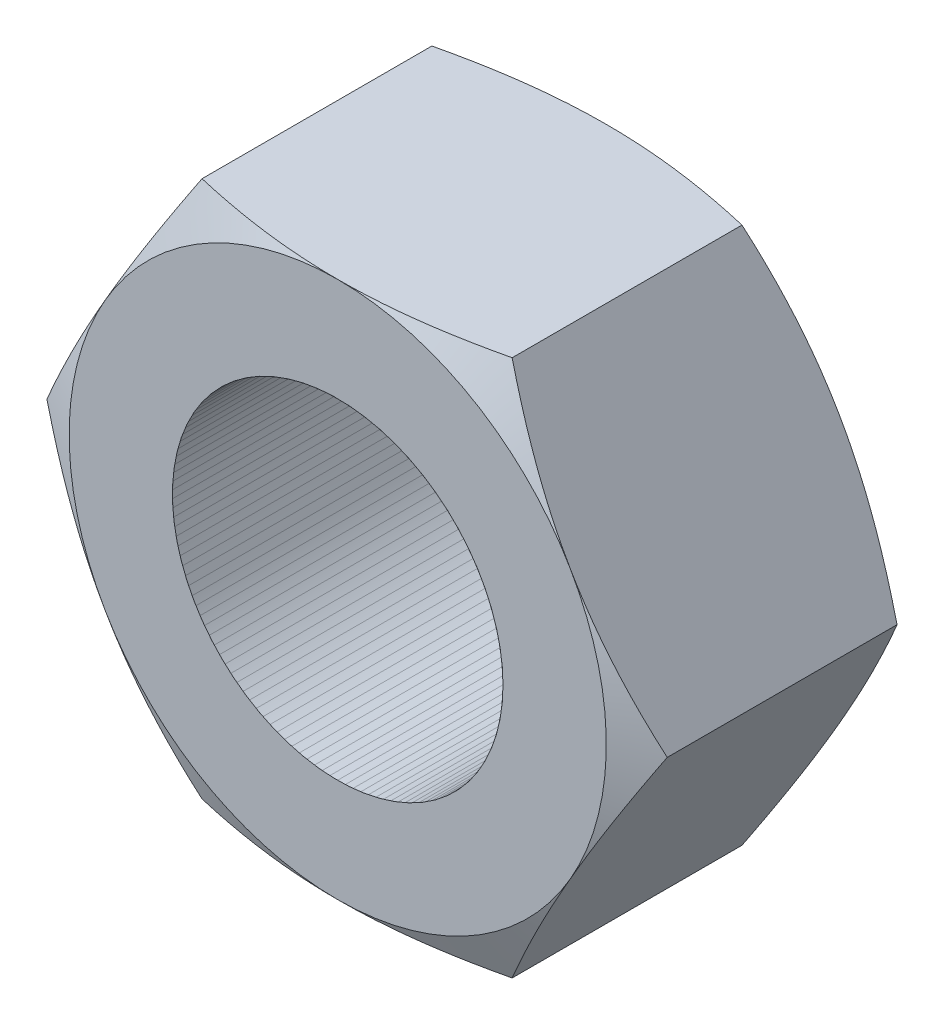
ISO-10303-21;
HEADER;
FILE_DESCRIPTION(('STEP AP214'),'2;1');
FILE_NAME('part.step','',(''),(''),'','','');
FILE_SCHEMA(('AUTOMOTIVE_DESIGN { 1 0 10303 214 1 1 1 1 }'));
ENDSEC;
DATA;
#1=APPLICATION_CONTEXT('core data for automotive mechanical design processes');
#2=APPLICATION_PROTOCOL_DEFINITION('international standard','automotive_design',2000,#1);
#3=PRODUCT_CONTEXT('',#1,'mechanical');
#4=PRODUCT('Part','Part','',(#3));
#5=PRODUCT_RELATED_PRODUCT_CATEGORY('part','',(#4));
#6=PRODUCT_DEFINITION_FORMATION('','',#4);
#7=PRODUCT_DEFINITION_CONTEXT('part definition',#1,'design');
#8=PRODUCT_DEFINITION('design','',#6,#7);
#9=PRODUCT_DEFINITION_SHAPE('','',#8);
#10=(LENGTH_UNIT() NAMED_UNIT(*) SI_UNIT(.MILLI.,.METRE.));
#11=(NAMED_UNIT(*) PLANE_ANGLE_UNIT() SI_UNIT($,.RADIAN.));
#12=(NAMED_UNIT(*) SI_UNIT($,.STERADIAN.) SOLID_ANGLE_UNIT());
#13=UNCERTAINTY_MEASURE_WITH_UNIT(LENGTH_MEASURE(1.E-05),#10,'distance_accuracy_value','');
#14=(GEOMETRIC_REPRESENTATION_CONTEXT(3) GLOBAL_UNCERTAINTY_ASSIGNED_CONTEXT((#13)) GLOBAL_UNIT_ASSIGNED_CONTEXT((#10,
#11,#12)) REPRESENTATION_CONTEXT('',''));
#15=CARTESIAN_POINT('',(0.,0.,0.));
#16=DIRECTION('',(0.,0.,1.));
#17=DIRECTION('',(1.,0.,0.));
#18=AXIS2_PLACEMENT_3D('',#15,#16,#17);
#19=CARTESIAN_POINT('',(0.,0.,6.02828931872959));
#20=DIRECTION('',(0.,0.,-1.));
#21=DIRECTION('',(0.,1.,0.));
#22=AXIS2_PLACEMENT_3D('',#19,#20,#21);
#23=CONICAL_SURFACE('',#22,7.51158682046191,1.1344640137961);
#24=CARTESIAN_POINT('',(-3.75277674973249,-6.49999999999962,6.03110270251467));
#25=CARTESIAN_POINT('',(-3.90672693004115,-6.23335046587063,6.10291701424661));
#26=CARTESIAN_POINT('',(-4.0615065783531,-5.9652642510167,6.16845555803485));
#27=CARTESIAN_POINT('',(-4.37197251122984,-5.42752148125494,6.28382196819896));
#28=CARTESIAN_POINT('',(-4.52765399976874,-5.15787323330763,6.33370190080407));
#29=CARTESIAN_POINT('',(-4.76213692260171,-4.7517368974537,6.39477850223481));
#30=CARTESIAN_POINT('',(-4.84049148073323,-4.61602282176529,6.41285157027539));
#31=CARTESIAN_POINT('',(-4.99744517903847,-4.3441710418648,6.44410021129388));
#32=CARTESIAN_POINT('',(-5.07604431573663,-4.20803334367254,6.45727585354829));
#33=CARTESIAN_POINT('',(-5.23367989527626,-3.93500051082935,6.47850910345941));
#34=CARTESIAN_POINT('',(-5.31271692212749,-3.79810436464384,6.48654948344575));
#35=CARTESIAN_POINT('',(-5.47089023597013,-3.52414014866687,6.49730462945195));
#36=CARTESIAN_POINT('',(-5.55002653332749,-3.38707206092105,6.5000187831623));
#37=CARTESIAN_POINT('',(-5.62916506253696,-3.25000010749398,6.5));
#38=B_SPLINE_CURVE_WITH_KNOTS('',3,(#24,#25,#26,#27,#28,#29,#30,#31,#32,#33,#34,#35,#36,#37),
.UNSPECIFIED.,.F.,.F.,(4,2,2,2,2,2,4),(0.,0.94873235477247,1.89427583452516,2.36744950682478,
2.84061648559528,3.31536261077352,3.7901633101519),.UNSPECIFIED.);
#39=CARTESIAN_POINT('',(-3.75277674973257,-6.49999999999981,6.03110270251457));
#40=VERTEX_POINT('',#39);
#41=CARTESIAN_POINT('',(-5.62916509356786,-3.25000005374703,6.49999999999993));
#42=VERTEX_POINT('',#41);
#43=EDGE_CURVE('P0_E21',#40,#42,#38,.T.);
#44=ORIENTED_EDGE('',*,*,#43,.F.);
#45=CARTESIAN_POINT('',(-2.58310512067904E-10,-6.5,6.49999999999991));
#46=CARTESIAN_POINT('',(-0.158277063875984,-6.5,6.50001878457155));
#47=CARTESIAN_POINT('',(-0.316549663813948,-6.5,6.49730463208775));
#48=CARTESIAN_POINT('',(-0.63289630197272,-6.5,6.48654948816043));
#49=CARTESIAN_POINT('',(-0.790970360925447,-6.5,6.47850910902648));
#50=CARTESIAN_POINT('',(-1.10624153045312,-6.5,6.45727586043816));
#51=CARTESIAN_POINT('',(-1.26343980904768,-6.5,6.44410021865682));
#52=CARTESIAN_POINT('',(-1.57734721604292,-6.5,6.41285157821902));
#53=CARTESIAN_POINT('',(-1.73405633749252,-6.5,6.39477851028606));
#54=CARTESIAN_POINT('',(-2.20302219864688,-6.5,6.33370190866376));
#55=CARTESIAN_POINT('',(-2.51438518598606,-6.5,6.28382197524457));
#56=CARTESIAN_POINT('',(-3.13531707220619,-6.5,6.16845556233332));
#57=CARTESIAN_POINT('',(-3.44487637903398,-6.5,6.10291701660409));
#58=CARTESIAN_POINT('',(-3.75277674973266,-6.5,6.03110270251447));
#59=B_SPLINE_CURVE_WITH_KNOTS('',3,(#45,#46,#47,#48,#49,#50,#51,#52,#53,#54,#55,#56,#57,#58),
.UNSPECIFIED.,.F.,.F.,(4,2,2,2,2,2,4),(0.,0.474800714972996,0.9495468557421,1.42271384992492,
1.89588753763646,2.84143104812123,3.79016343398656),.UNSPECIFIED.);
#60=CARTESIAN_POINT('',(-1.29156532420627E-10,-6.49999999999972,6.50000000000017));
#61=VERTEX_POINT('',#60);
#62=EDGE_CURVE('P0_E122',#61,#40,#59,.T.);
#63=ORIENTED_EDGE('',*,*,#62,.F.);
#64=CARTESIAN_POINT('',(0.,0.,6.49999999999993));
#65=DIRECTION('',(0.,0.,-1.));
#66=DIRECTION('',(0.,1.,0.));
#67=AXIS2_PLACEMENT_3D('',#64,#65,#66);
#68=CIRCLE('',#67,6.49999999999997);
#69=EDGE_CURVE('P0_E120',#42,#61,#68,.F.);
#70=ORIENTED_EDGE('',*,*,#69,.F.);
#71=EDGE_LOOP('',(#44,#63,#70));
#72=FACE_BOUND('',#71,.T.);
#73=ADVANCED_FACE('P0_F17',(#72),#23,.T.);
#74=CARTESIAN_POINT('',(0.,0.,6.02828931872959));
#75=DIRECTION('',(0.,0.,-1.));
#76=DIRECTION('',(-1.,0.,0.));
#77=AXIS2_PLACEMENT_3D('',#74,#75,#76);
#78=CONICAL_SURFACE('',#77,7.51158682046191,1.1344640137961);
#79=CARTESIAN_POINT('',(3.75277674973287,-6.5,6.03110270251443));
#80=CARTESIAN_POINT('',(3.44487637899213,-6.5,6.10291701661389));
#81=CARTESIAN_POINT('',(3.13531707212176,-6.5,6.16845556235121));
#82=CARTESIAN_POINT('',(2.51438518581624,-6.5,6.28382197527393));
#83=CARTESIAN_POINT('',(2.20302219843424,-6.5,6.33370190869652));
#84=CARTESIAN_POINT('',(1.73405633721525,-6.5,6.39477851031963));
#85=CARTESIAN_POINT('',(1.57734721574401,-6.5,6.41285157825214));
#86=CARTESIAN_POINT('',(1.26343980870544,-6.5,6.44410021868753));
#87=CARTESIAN_POINT('',(1.10624153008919,-6.5,6.45727586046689));
#88=CARTESIAN_POINT('',(0.790970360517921,-6.5,6.47850910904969));
#89=CARTESIAN_POINT('',(0.632896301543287,-6.5,6.4865494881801));
#90=CARTESIAN_POINT('',(0.316549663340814,-6.5,6.49730463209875));
#91=CARTESIAN_POINT('',(0.158277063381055,-6.5,6.50001878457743));
#92=CARTESIAN_POINT('',(-2.58309852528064E-10,-6.5,6.49999999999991));
#93=B_SPLINE_CURVE_WITH_KNOTS('',3,(#79,#80,#81,#82,#83,#84,#85,#86,#87,#88,#89,#90,#91,#92),
.UNSPECIFIED.,.F.,.F.,(4,2,2,2,2,2,4),(0.,0.948732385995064,1.89427589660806,2.36744958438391,
2.84061657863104,3.3153627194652,3.79016343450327),.UNSPECIFIED.);
#94=CARTESIAN_POINT('',(3.75277674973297,-6.49999999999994,6.03110270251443));
#95=VERTEX_POINT('',#94);
#96=EDGE_CURVE('P0_E142',#95,#61,#93,.T.);
#97=ORIENTED_EDGE('',*,*,#96,.F.);
#98=CARTESIAN_POINT('',(5.62916512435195,-3.25000000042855,6.4999999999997));
#99=CARTESIAN_POINT('',(5.55002659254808,-3.38707195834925,6.50001878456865));
#100=CARTESIAN_POINT('',(5.47089029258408,-3.52414005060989,6.49730463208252));
#101=CARTESIAN_POINT('',(5.3127169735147,-3.79810427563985,6.48654948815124));
#102=CARTESIAN_POINT('',(5.23367994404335,-3.93500042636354,6.47850910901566));
#103=CARTESIAN_POINT('',(5.07604435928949,-4.20803326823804,6.45727586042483));
#104=CARTESIAN_POINT('',(4.99744521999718,-4.34417097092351,6.4441002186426));
#105=CARTESIAN_POINT('',(4.84049151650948,-4.6160227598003,6.4128515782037));
#106=CARTESIAN_POINT('',(4.76213695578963,-4.75173683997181,6.39477851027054));
#107=CARTESIAN_POINT('',(4.52765402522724,-5.15787318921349,6.33370190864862));
#108=CARTESIAN_POINT('',(4.37197253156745,-5.42752144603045,6.28382197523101));
#109=CARTESIAN_POINT('',(4.06150658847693,-5.965264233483,6.16845556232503));
#110=CARTESIAN_POINT('',(3.90672693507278,-6.23335045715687,6.10291701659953));
#111=CARTESIAN_POINT('',(3.75277674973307,-6.49999999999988,6.03110270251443));
#112=B_SPLINE_CURVE_WITH_KNOTS('',3,(#98,#99,#100,#101,#102,#103,#104,#105,#106,#107,#108,#109,
#110,#111),.UNSPECIFIED.,.F.,.F.,(4,2,2,2,2,2,4),(0.,0.47480071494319,0.949546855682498,
1.42271384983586,1.89588753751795,2.84143104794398,3.79016343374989),.UNSPECIFIED.);
#113=CARTESIAN_POINT('',(5.62916512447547,-3.25000000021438,6.49999999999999));
#114=VERTEX_POINT('',#113);
#115=EDGE_CURVE('P0_E291',#114,#95,#112,.T.);
#116=ORIENTED_EDGE('',*,*,#115,.F.);
#117=CARTESIAN_POINT('',(0.,0.,6.50000000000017));
#118=DIRECTION('',(0.,0.,-1.));
#119=DIRECTION('',(-1.,0.,0.));
#120=AXIS2_PLACEMENT_3D('',#117,#118,#119);
#121=CIRCLE('',#120,6.49999999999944);
#122=EDGE_CURVE('P0_E125',#61,#114,#121,.F.);
#123=ORIENTED_EDGE('',*,*,#122,.F.);
#124=EDGE_LOOP('',(#97,#116,#123));
#125=FACE_BOUND('',#124,.T.);
#126=ADVANCED_FACE('P0_F281',(#125),#78,.T.);
#127=CARTESIAN_POINT('',(0.,0.,6.02828931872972));
#128=DIRECTION('',(0.,0.,-1.));
#129=DIRECTION('',(-1.,0.,0.));
#130=AXIS2_PLACEMENT_3D('',#127,#128,#129);
#131=CONICAL_SURFACE('',#130,7.51158682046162,1.1344640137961);
#132=CARTESIAN_POINT('',(5.62916507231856,3.25000009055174,6.5));
#133=CARTESIAN_POINT('',(5.70830360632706,3.11292812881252,6.50001878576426));
#134=CARTESIAN_POINT('',(5.78743990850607,2.97586003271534,6.49730463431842));
#135=CARTESIAN_POINT('',(5.94561323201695,2.70189579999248,6.48654949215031));
#136=CARTESIAN_POINT('',(6.02465026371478,2.56499964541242,6.47850911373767));
#137=CARTESIAN_POINT('',(6.1822858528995,2.29196679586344,6.45727586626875));
#138=CARTESIAN_POINT('',(6.26088499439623,2.15582908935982,6.44410022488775));
#139=CARTESIAN_POINT('',(6.41783870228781,1.88397729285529,6.41285158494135));
#140=CARTESIAN_POINT('',(6.49619326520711,1.7482632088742,6.39477851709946));
#141=CARTESIAN_POINT('',(6.73067620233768,1.3421268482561,6.33370191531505));
#142=CARTESIAN_POINT('',(6.88635770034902,1.07247858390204,6.28382198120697));
#143=CARTESIAN_POINT('',(7.19682365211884,0.534735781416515,6.16845556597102));
#144=CARTESIAN_POINT('',(7.35160330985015,0.26664955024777,6.10291701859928));
#145=CARTESIAN_POINT('',(7.50555349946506,0.,6.03110270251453));
#146=B_SPLINE_CURVE_WITH_KNOTS('',3,(#132,#133,#134,#135,#136,#137,#138,#139,#140,#141,#142,
#143,#144,#145),.UNSPECIFIED.,.F.,.F.,(4,2,2,2,2,2,4),(0.,0.474800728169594,0.949546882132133,
1.42271388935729,1.89588759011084,2.84143112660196,3.79016353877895),.UNSPECIFIED.);
#147=CARTESIAN_POINT('',(5.62916509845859,3.25000004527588,6.4999999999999));
#148=VERTEX_POINT('',#147);
#149=CARTESIAN_POINT('',(7.50555349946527,-2.73661070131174E-13,6.03110270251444));
#150=VERTEX_POINT('',#149);
#151=EDGE_CURVE('P0_E261',#148,#150,#146,.T.);
#152=ORIENTED_EDGE('',*,*,#151,.F.);
#153=CARTESIAN_POINT('',(0.,0.,6.4999999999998));
#154=DIRECTION('',(0.,0.,-1.));
#155=DIRECTION('',(-1.,0.,0.));
#156=AXIS2_PLACEMENT_3D('',#153,#154,#155);
#157=CIRCLE('',#156,6.50000000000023);
#158=EDGE_CURVE('P0_E351',#114,#148,#157,.F.);
#159=ORIENTED_EDGE('',*,*,#158,.F.);
#160=CARTESIAN_POINT('',(7.50555349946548,-4.51244910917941E-13,6.03110270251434));
#161=CARTESIAN_POINT('',(7.35160331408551,-0.266649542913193,6.10291701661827));
#162=CARTESIAN_POINT('',(7.19682366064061,-0.534735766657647,6.16845556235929));
#163=CARTESIAN_POINT('',(6.88635771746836,-1.07247855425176,6.28382197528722));
#164=CARTESIAN_POINT('',(6.73067622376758,-1.34212681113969,6.33370190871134));
#165=CARTESIAN_POINT('',(6.49619329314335,-1.74826316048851,6.39477851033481));
#166=CARTESIAN_POINT('',(6.41783873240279,-1.88397724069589,6.41285157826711));
#167=CARTESIAN_POINT('',(6.26088502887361,-2.15582902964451,6.44410021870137));
#168=CARTESIAN_POINT('',(6.18228588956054,-2.29196673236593,6.45727586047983));
#169=CARTESIAN_POINT('',(6.02465030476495,-2.5649995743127,6.47850910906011));
#170=CARTESIAN_POINT('',(5.94561327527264,-2.70189572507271,6.48654948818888));
#171=CARTESIAN_POINT('',(5.78743995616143,-2.97585995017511,6.49730463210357));
#172=CARTESIAN_POINT('',(5.70830365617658,-3.11292804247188,6.50001878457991));
#173=CARTESIAN_POINT('',(5.62916512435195,-3.25000000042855,6.4999999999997));
#174=B_SPLINE_CURVE_WITH_KNOTS('',3,(#160,#161,#162,#163,#164,#165,#166,#167,#168,#169,#170,
#171,#172,#173),.UNSPECIFIED.,.F.,.F.,(4,2,2,2,2,2,4),(0.,0.94873238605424,1.89427589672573,
2.36744958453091,2.84061657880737,3.3153627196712,3.79016343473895),.UNSPECIFIED.);
#175=EDGE_CURVE('P0_E287',#150,#114,#174,.T.);
#176=ORIENTED_EDGE('',*,*,#175,.F.);
#177=EDGE_LOOP('',(#152,#159,#176));
#178=FACE_BOUND('',#177,.T.);
#179=ADVANCED_FACE('P0_F277',(#178),#131,.T.);
#180=CARTESIAN_POINT('',(0.,0.,6.02828931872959));
#181=DIRECTION('',(0.,0.,-1.));
#182=DIRECTION('',(-1.,0.,0.));
#183=AXIS2_PLACEMENT_3D('',#180,#181,#182);
#184=CONICAL_SURFACE('',#183,7.51158682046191,1.1344640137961);
#185=CARTESIAN_POINT('',(3.75277674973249,6.49999999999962,6.03110270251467));
#186=CARTESIAN_POINT('',(3.90672693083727,6.23335046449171,6.10291701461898));
#187=CARTESIAN_POINT('',(4.06150657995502,5.9652642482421,6.16845555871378));
#188=CARTESIAN_POINT('',(4.371972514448,5.42752147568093,6.28382196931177));
#189=CARTESIAN_POINT('',(4.52765400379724,5.15787322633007,6.33370190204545));
#190=CARTESIAN_POINT('',(4.76213692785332,4.75173688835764,6.39477850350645));
#191=CARTESIAN_POINT('',(4.84049148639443,4.61602281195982,6.41285157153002));
#192=CARTESIAN_POINT('',(4.99744518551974,4.34417103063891,6.44410021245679));
#193=CARTESIAN_POINT('',(5.07604432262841,4.20803333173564,6.45727585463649));
#194=CARTESIAN_POINT('',(5.23367990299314,3.93500049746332,6.47850910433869));
#195=CARTESIAN_POINT('',(5.31271693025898,3.79810435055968,6.4865494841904));
#196=CARTESIAN_POINT('',(5.47089024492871,3.52414013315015,6.49730462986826));
#197=CARTESIAN_POINT('',(5.55002654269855,3.3870720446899,6.50001878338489));
#198=CARTESIAN_POINT('',(5.62916507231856,3.25000009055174,6.5));
#199=B_SPLINE_CURVE_WITH_KNOTS('',3,(#185,#186,#187,#188,#189,#190,#191,#192,#193,#194,#195,
#196,#197,#198),.UNSPECIFIED.,.F.,.F.,(4,2,2,2,2,2,4),(0.,0.948732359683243,1.89427584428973,
2.36744951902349,2.8406165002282,3.31536262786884,3.79016332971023),.UNSPECIFIED.);
#200=CARTESIAN_POINT('',(3.75277674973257,6.49999999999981,6.03110270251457));
#201=VERTEX_POINT('',#200);
#202=EDGE_CURVE('P0_E268',#201,#148,#199,.T.);
#203=ORIENTED_EDGE('',*,*,#202,.F.);
#204=CARTESIAN_POINT('',(2.58309719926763E-10,6.5,6.49999999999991));
#205=CARTESIAN_POINT('',(0.158277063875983,6.5,6.50001878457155));
#206=CARTESIAN_POINT('',(0.316549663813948,6.5,6.49730463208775));
#207=CARTESIAN_POINT('',(0.632896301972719,6.5,6.48654948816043));
#208=CARTESIAN_POINT('',(0.790970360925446,6.5,6.47850910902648));
#209=CARTESIAN_POINT('',(1.10624153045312,6.5,6.45727586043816));
#210=CARTESIAN_POINT('',(1.26343980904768,6.5,6.44410021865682));
#211=CARTESIAN_POINT('',(1.57734721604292,6.5,6.41285157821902));
#212=CARTESIAN_POINT('',(1.73405633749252,6.5,6.39477851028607));
#213=CARTESIAN_POINT('',(2.20302219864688,6.5,6.33370190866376));
#214=CARTESIAN_POINT('',(2.51438518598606,6.5,6.28382197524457));
#215=CARTESIAN_POINT('',(3.13531707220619,6.5,6.16845556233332));
#216=CARTESIAN_POINT('',(3.44487637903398,6.5,6.10291701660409));
#217=CARTESIAN_POINT('',(3.75277674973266,6.5,6.03110270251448));
#218=B_SPLINE_CURVE_WITH_KNOTS('',3,(#204,#205,#206,#207,#208,#209,#210,#211,#212,#213,#214,
#215,#216,#217),.UNSPECIFIED.,.F.,.F.,(4,2,2,2,2,2,4),(0.,0.474800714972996,0.949546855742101,
1.42271384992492,1.89588753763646,2.84143104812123,3.79016343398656),.UNSPECIFIED.);
#219=CARTESIAN_POINT('',(1.29154859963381E-10,6.5,6.50000000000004));
#220=VERTEX_POINT('',#219);
#221=EDGE_CURVE('P0_E173',#220,#201,#218,.T.);
#222=ORIENTED_EDGE('',*,*,#221,.F.);
#223=CARTESIAN_POINT('',(0.,0.,6.49999999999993));
#224=DIRECTION('',(0.,0.,-1.));
#225=DIRECTION('',(-1.,0.,0.));
#226=AXIS2_PLACEMENT_3D('',#223,#224,#225);
#227=CIRCLE('',#226,6.49999999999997);
#228=EDGE_CURVE('P0_E349',#148,#220,#227,.F.);
#229=ORIENTED_EDGE('',*,*,#228,.F.);
#230=EDGE_LOOP('',(#203,#222,#229));
#231=FACE_BOUND('',#230,.T.);
#232=ADVANCED_FACE('P0_F280',(#231),#184,.T.);
#233=CARTESIAN_POINT('',(0.,0.,6.02828931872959));
#234=DIRECTION('',(0.,0.,-1.));
#235=DIRECTION('',(-1.,0.,0.));
#236=AXIS2_PLACEMENT_3D('',#233,#234,#235);
#237=CONICAL_SURFACE('',#236,7.51158682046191,1.1344640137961);
#238=CARTESIAN_POINT('',(-3.75277674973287,6.5,6.03110270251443));
#239=CARTESIAN_POINT('',(-3.44487637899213,6.5,6.10291701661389));
#240=CARTESIAN_POINT('',(-3.13531707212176,6.5,6.16845556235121));
#241=CARTESIAN_POINT('',(-2.51438518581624,6.5,6.28382197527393));
#242=CARTESIAN_POINT('',(-2.20302219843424,6.5,6.33370190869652));
#243=CARTESIAN_POINT('',(-1.73405633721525,6.5,6.39477851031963));
#244=CARTESIAN_POINT('',(-1.57734721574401,6.5,6.41285157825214));
#245=CARTESIAN_POINT('',(-1.26343980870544,6.5,6.44410021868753));
#246=CARTESIAN_POINT('',(-1.10624153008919,6.5,6.45727586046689));
#247=CARTESIAN_POINT('',(-0.79097036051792,6.5,6.47850910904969));
#248=CARTESIAN_POINT('',(-0.632896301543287,6.5,6.4865494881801));
#249=CARTESIAN_POINT('',(-0.316549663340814,6.5,6.49730463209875));
#250=CARTESIAN_POINT('',(-0.158277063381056,6.5,6.50001878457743));
#251=CARTESIAN_POINT('',(2.58309825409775E-10,6.5,6.49999999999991));
#252=B_SPLINE_CURVE_WITH_KNOTS('',3,(#238,#239,#240,#241,#242,#243,#244,#245,#246,#247,#248,
#249,#250,#251),.UNSPECIFIED.,.F.,.F.,(4,2,2,2,2,2,4),(0.,0.948732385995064,1.89427589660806,
2.36744958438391,2.84061657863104,3.3153627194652,3.79016343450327),.UNSPECIFIED.);
#253=CARTESIAN_POINT('',(-3.75277674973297,6.49999999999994,6.03110270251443));
#254=VERTEX_POINT('',#253);
#255=EDGE_CURVE('P0_E269',#254,#220,#252,.T.);
#256=ORIENTED_EDGE('',*,*,#255,.F.);
#257=CARTESIAN_POINT('',(-5.62916512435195,3.25000000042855,6.4999999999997));
#258=CARTESIAN_POINT('',(-5.55002659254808,3.38707195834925,6.50001878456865));
#259=CARTESIAN_POINT('',(-5.47089029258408,3.52414005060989,6.49730463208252));
#260=CARTESIAN_POINT('',(-5.3127169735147,3.79810427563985,6.48654948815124));
#261=CARTESIAN_POINT('',(-5.23367994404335,3.93500042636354,6.47850910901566));
#262=CARTESIAN_POINT('',(-5.07604435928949,4.20803326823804,6.45727586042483));
#263=CARTESIAN_POINT('',(-4.99744521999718,4.34417097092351,6.4441002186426));
#264=CARTESIAN_POINT('',(-4.84049151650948,4.6160227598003,6.4128515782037));
#265=CARTESIAN_POINT('',(-4.76213695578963,4.75173683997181,6.39477851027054));
#266=CARTESIAN_POINT('',(-4.52765402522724,5.15787318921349,6.33370190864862));
#267=CARTESIAN_POINT('',(-4.37197253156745,5.42752144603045,6.28382197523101));
#268=CARTESIAN_POINT('',(-4.06150658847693,5.965264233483,6.16845556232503));
#269=CARTESIAN_POINT('',(-3.90672693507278,6.23335045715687,6.10291701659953));
#270=CARTESIAN_POINT('',(-3.75277674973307,6.49999999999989,6.03110270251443));
#271=B_SPLINE_CURVE_WITH_KNOTS('',3,(#257,#258,#259,#260,#261,#262,#263,#264,#265,#266,#267,
#268,#269,#270),.UNSPECIFIED.,.F.,.F.,(4,2,2,2,2,2,4),(0.,0.474800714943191,0.949546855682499,
1.42271384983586,1.89588753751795,2.84143104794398,3.79016343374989),.UNSPECIFIED.);
#272=CARTESIAN_POINT('',(-5.62916512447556,3.25000000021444,6.49999999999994));
#273=VERTEX_POINT('',#272);
#274=EDGE_CURVE('P0_E126',#273,#254,#271,.T.);
#275=ORIENTED_EDGE('',*,*,#274,.F.);
#276=CARTESIAN_POINT('',(0.,0.,6.50000000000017));
#277=DIRECTION('',(0.,0.,-1.));
#278=DIRECTION('',(-1.,0.,0.));
#279=AXIS2_PLACEMENT_3D('',#276,#277,#278);
#280=CIRCLE('',#279,6.49999999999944);
#281=EDGE_CURVE('P0_E134',#220,#273,#280,.F.);
#282=ORIENTED_EDGE('',*,*,#281,.F.);
#283=EDGE_LOOP('',(#256,#275,#282));
#284=FACE_BOUND('',#283,.T.);
#285=ADVANCED_FACE('P0_F158',(#284),#237,.T.);
#286=CARTESIAN_POINT('',(0.,0.,6.02828931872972));
#287=DIRECTION('',(0.,0.,-1.));
#288=DIRECTION('',(-1.,0.,0.));
#289=AXIS2_PLACEMENT_3D('',#286,#287,#288);
#290=CONICAL_SURFACE('',#289,7.51158682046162,1.1344640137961);
#291=CARTESIAN_POINT('',(-7.5055534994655,4.06582802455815E-13,6.03110270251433));
#292=CARTESIAN_POINT('',(-7.35160331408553,0.266649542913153,6.10291701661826));
#293=CARTESIAN_POINT('',(-7.19682366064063,0.534735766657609,6.16845556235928));
#294=CARTESIAN_POINT('',(-6.88635771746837,1.07247855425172,6.28382197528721));
#295=CARTESIAN_POINT('',(-6.7306762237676,1.34212681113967,6.33370190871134));
#296=CARTESIAN_POINT('',(-6.49619329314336,1.74826316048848,6.3947785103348));
#297=CARTESIAN_POINT('',(-6.4178387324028,1.88397724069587,6.4128515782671));
#298=CARTESIAN_POINT('',(-6.26088502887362,2.1558290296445,6.44410021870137));
#299=CARTESIAN_POINT('',(-6.18228588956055,2.29196673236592,6.45727586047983));
#300=CARTESIAN_POINT('',(-6.02465030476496,2.56499957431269,6.47850910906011));
#301=CARTESIAN_POINT('',(-5.94561327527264,2.7018957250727,6.48654948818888));
#302=CARTESIAN_POINT('',(-5.78743995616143,2.97585995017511,6.49730463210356));
#303=CARTESIAN_POINT('',(-5.70830365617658,3.11292804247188,6.5000187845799));
#304=CARTESIAN_POINT('',(-5.62916512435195,3.25000000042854,6.4999999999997));
#305=B_SPLINE_CURVE_WITH_KNOTS('',3,(#291,#292,#293,#294,#295,#296,#297,#298,#299,#300,#301,
#302,#303,#304),.UNSPECIFIED.,.F.,.F.,(4,2,2,2,2,2,4),(0.,0.948732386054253,1.89427589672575,
2.36744958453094,2.84061657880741,3.31536271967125,3.790163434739),.UNSPECIFIED.);
#306=CARTESIAN_POINT('',(-7.50555349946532,2.29273092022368E-13,6.03110270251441));
#307=VERTEX_POINT('',#306);
#308=EDGE_CURVE('P0_E141',#307,#273,#305,.T.);
#309=ORIENTED_EDGE('',*,*,#308,.F.);
#310=CARTESIAN_POINT('',(-5.62916506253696,-3.25000010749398,6.5));
#311=CARTESIAN_POINT('',(-5.708303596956,-3.11292814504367,6.50001878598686));
#312=CARTESIAN_POINT('',(-5.78743989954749,-2.97586004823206,6.49730463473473));
#313=CARTESIAN_POINT('',(-5.94561322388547,-2.70189581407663,6.48654949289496));
#314=CARTESIAN_POINT('',(-6.0246502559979,-2.56499965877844,6.47850911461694));
#315=CARTESIAN_POINT('',(-6.18228584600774,-2.29196680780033,6.45727586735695));
#316=CARTESIAN_POINT('',(-6.26088498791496,-2.1558291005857,6.44410022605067));
#317=CARTESIAN_POINT('',(-6.41783869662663,-1.88397730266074,6.41285158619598));
#318=CARTESIAN_POINT('',(-6.49619325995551,-1.74826321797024,6.39477851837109));
#319=CARTESIAN_POINT('',(-6.7306761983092,-1.34212685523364,6.33370191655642));
#320=CARTESIAN_POINT('',(-6.88635769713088,-1.07247858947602,6.28382198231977));
#321=CARTESIAN_POINT('',(-7.19682365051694,-0.534735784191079,6.16845556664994));
#322=CARTESIAN_POINT('',(-7.35160330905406,-0.266649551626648,6.10291701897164));
#323=CARTESIAN_POINT('',(-7.50555349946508,1.40998818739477E-13,6.03110270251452));
#324=B_SPLINE_CURVE_WITH_KNOTS('',3,(#310,#311,#312,#313,#314,#315,#316,#317,#318,#319,#320,
#321,#322,#323),.UNSPECIFIED.,.F.,.F.,(4,2,2,2,2,2,4),(0.,0.474800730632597,0.949546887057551,
1.42271389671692,1.89588759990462,2.84143114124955,3.79016355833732),.UNSPECIFIED.);
#325=EDGE_CURVE('P0_E115',#42,#307,#324,.T.);
#326=ORIENTED_EDGE('',*,*,#325,.F.);
#327=CARTESIAN_POINT('',(0.,0.,6.49999999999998));
#328=DIRECTION('',(0.,0.,-1.));
#329=DIRECTION('',(-1.,0.,0.));
#330=AXIS2_PLACEMENT_3D('',#327,#328,#329);
#331=CIRCLE('',#330,6.49999999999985);
#332=EDGE_CURVE('P0_E130',#273,#42,#331,.F.);
#333=ORIENTED_EDGE('',*,*,#332,.F.);
#334=EDGE_LOOP('',(#309,#326,#333));
#335=FACE_BOUND('',#334,.T.);
#336=ADVANCED_FACE('P0_F140',(#335),#290,.T.);
#337=CARTESIAN_POINT('',(-7.505553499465,0.,0.));
#338=DIRECTION('',(-0.866025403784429,-0.500000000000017,0.));
#339=DIRECTION('',(0.500000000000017,-0.866025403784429,0.));
#340=AXIS2_PLACEMENT_3D('',#337,#338,#339);
#341=PLANE('',#340);
#342=ORIENTED_EDGE('',*,*,#43,.T.);
#343=ORIENTED_EDGE('',*,*,#325,.T.);
#344=DIRECTION('',(0.,0.,1.));
#345=VECTOR('',#344,1.);
#346=CARTESIAN_POINT('',(-7.50555349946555,3.17454396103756E-13,0.));
#347=LINE('',#346,#345);
#348=CARTESIAN_POINT('',(-7.50555347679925,-3.92585487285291E-08,0.468897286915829));
#349=VERTEX_POINT('',#348);
#350=EDGE_CURVE('P0_E169',#349,#307,#347,.T.);
#351=ORIENTED_EDGE('',*,*,#350,.F.);
#352=CARTESIAN_POINT('',(-5.6291651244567,-3.25000000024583,-3.95874665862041E-13));
#353=CARTESIAN_POINT('',(-5.70830365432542,-3.1129280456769,-1.87845763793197E-05));
#354=CARTESIAN_POINT('',(-5.78743995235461,-2.97585995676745,0.00269536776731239));
#355=CARTESIAN_POINT('',(-5.94561326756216,-2.70189573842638,0.013450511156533));
#356=CARTESIAN_POINT('',(-6.02465029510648,-2.5649995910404,0.0214908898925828));
#357=CARTESIAN_POINT('',(-6.18228587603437,-2.29196675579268,0.0427241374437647));
#358=CARTESIAN_POINT('',(-6.26088501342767,-2.1558290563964,0.0558997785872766));
#359=CARTESIAN_POINT('',(-6.41783871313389,-1.88397727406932,0.0871484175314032));
#360=CARTESIAN_POINT('',(-6.49619327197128,-1.74826319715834,0.105221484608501));
#361=CARTESIAN_POINT('',(-6.73067619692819,-1.34212685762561,0.166298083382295));
#362=CARTESIAN_POINT('',(-6.88635768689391,-1.07247860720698,0.216178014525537));
#363=CARTESIAN_POINT('',(-7.19682362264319,-0.534735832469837,0.331544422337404));
#364=CARTESIAN_POINT('',(-7.3516032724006,-0.266649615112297,0.397082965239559));
#365=CARTESIAN_POINT('',(-7.50555345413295,-7.85174151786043E-08,0.46889727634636));
#366=B_SPLINE_CURVE_WITH_KNOTS('',3,(#352,#353,#354,#355,#356,#357,#358,#359,#360,#361,#362,
#363,#364,#365),.UNSPECIFIED.,.F.,.F.,(4,2,2,2,2,2,4),(0.,0.474800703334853,0.949546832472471,
1.42271381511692,1.89588749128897,2.84143097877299,3.79016334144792),.UNSPECIFIED.);
#367=CARTESIAN_POINT('',(-5.62916512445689,-3.25000000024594,-2.95341065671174E-13));
#368=VERTEX_POINT('',#367);
#369=EDGE_CURVE('P0_E138',#368,#349,#366,.T.);
#370=ORIENTED_EDGE('',*,*,#369,.F.);
#371=CARTESIAN_POINT('',(-3.75277679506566,-6.49999992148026,0.468897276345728));
#372=CARTESIAN_POINT('',(-3.9067269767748,-6.23335038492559,0.397082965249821));
#373=CARTESIAN_POINT('',(-4.06150662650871,-5.96526416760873,0.331544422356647));
#374=CARTESIAN_POINT('',(-4.37197256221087,-5.42752139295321,0.216178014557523));
#375=CARTESIAN_POINT('',(-4.52765405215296,-5.1578731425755,0.16629808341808));
#376=CARTESIAN_POINT('',(-4.76213697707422,-4.75173680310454,0.105221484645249));
#377=CARTESIAN_POINT('',(-4.84049153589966,-4.61602272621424,0.0871484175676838));
#378=CARTESIAN_POINT('',(-4.99744523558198,-4.34417094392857,0.0558997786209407));
#379=CARTESIAN_POINT('',(-5.07604437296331,-4.20803324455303,0.0427241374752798));
#380=CARTESIAN_POINT('',(-5.23367995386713,-3.93500040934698,0.0214908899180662));
#381=CARTESIAN_POINT('',(-5.31271698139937,-3.79810426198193,0.0134505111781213));
#382=CARTESIAN_POINT('',(-5.4708902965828,-3.52414004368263,0.00269536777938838));
#383=CARTESIAN_POINT('',(-5.55002659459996,-3.38707195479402,-1.87845699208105E-05));
#384=CARTESIAN_POINT('',(-5.6291651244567,-3.25000000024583,-3.96136663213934E-13));
#385=B_SPLINE_CURVE_WITH_KNOTS('',3,(#371,#372,#373,#374,#375,#376,#377,#378,#379,#380,#381,
#382,#383,#384),.UNSPECIFIED.,.F.,.F.,(4,2,2,2,2,2,4),(0.,0.948732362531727,1.89427584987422,
2.36744952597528,2.84061650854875,3.31536263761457,3.7901633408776),.UNSPECIFIED.);
#386=CARTESIAN_POINT('',(-3.75277676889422,-6.5,0.468897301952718));
#387=VERTEX_POINT('',#386);
#388=EDGE_CURVE('P0_E333',#387,#368,#385,.T.);
#389=ORIENTED_EDGE('',*,*,#388,.F.);
#390=DIRECTION('',(0.,0.,-1.));
#391=VECTOR('',#390,1.);
#392=CARTESIAN_POINT('',(-3.752776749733,-6.5,0.));
#393=LINE('',#392,#391);
#394=EDGE_CURVE('P0_E118',#40,#387,#393,.T.);
#395=ORIENTED_EDGE('',*,*,#394,.F.);
#396=EDGE_LOOP('',(#342,#343,#351,#370,#389,#395));
#397=FACE_BOUND('',#396,.T.);
#398=ADVANCED_FACE('P0_F112',(#397),#341,.T.);
#399=CARTESIAN_POINT('',(-3.752776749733,-6.5,0.));
#400=DIRECTION('',(0.,-1.,0.));
#401=DIRECTION('',(0.,0.,-1.));
#402=AXIS2_PLACEMENT_3D('',#399,#400,#401);
#403=PLANE('',#402);
#404=ORIENTED_EDGE('',*,*,#96,.T.);
#405=ORIENTED_EDGE('',*,*,#62,.T.);
#406=ORIENTED_EDGE('',*,*,#394,.T.);
#407=CARTESIAN_POINT('',(-2.58312926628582E-10,-6.5,-3.07986611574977E-13));
#408=CARTESIAN_POINT('',(-0.158277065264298,-6.5,-1.87845725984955E-05));
#409=CARTESIAN_POINT('',(-0.316549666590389,-6.5,0.00269536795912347));
#410=CARTESIAN_POINT('',(-0.63289630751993,-6.5,0.0134505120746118));
#411=CARTESIAN_POINT('',(-0.790970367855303,-6.5,0.0214908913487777));
#412=CARTESIAN_POINT('',(-1.10624154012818,-6.5,0.0427241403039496));
#413=CARTESIAN_POINT('',(-1.26343982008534,-6.5,0.055899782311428));
#414=CARTESIAN_POINT('',(-1.57734722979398,-6.5,0.0871484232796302));
#415=CARTESIAN_POINT('',(-1.73405635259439,-6.5,0.105221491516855));
#416=CARTESIAN_POINT('',(-2.20302221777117,-6.5,0.166298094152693));
#417=CARTESIAN_POINT('',(-2.51438520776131,-6.5,0.21617802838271));
#418=CARTESIAN_POINT('',(-3.13531709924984,-6.5,0.331544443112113));
#419=CARTESIAN_POINT('',(-3.44487640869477,-6.5,0.397082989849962));
#420=CARTESIAN_POINT('',(-3.75277678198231,-6.5,0.468897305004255));
#421=B_SPLINE_CURVE_WITH_KNOTS('',3,(#407,#408,#409,#410,#411,#412,#413,#414,#415,#416,#417,
#418,#419,#420),.UNSPECIFIED.,.F.,.F.,(4,2,2,2,2,2,4),(0.,0.474800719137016,0.949546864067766,
1.42271386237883,1.89588755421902,2.84143107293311,3.79016346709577),.UNSPECIFIED.);
#422=CARTESIAN_POINT('',(-2.58314189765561E-10,-6.50000000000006,-2.80492594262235E-13));
#423=VERTEX_POINT('',#422);
#424=EDGE_CURVE('P0_E306',#423,#387,#421,.T.);
#425=ORIENTED_EDGE('',*,*,#424,.F.);
#426=CARTESIAN_POINT('',(3.75277665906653,-6.5,0.468897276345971));
#427=CARTESIAN_POINT('',(3.44487629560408,-6.5,0.397082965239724));
#428=CARTESIAN_POINT('',(3.13531699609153,-6.5,0.331544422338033));
#429=CARTESIAN_POINT('',(2.51438512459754,-6.5,0.216178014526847));
#430=CARTESIAN_POINT('',(2.20302214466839,-6.5,0.166298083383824));
#431=CARTESIAN_POINT('',(1.73405629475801,-6.5,0.105221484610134));
#432=CARTESIAN_POINT('',(1.57734717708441,-6.5,0.0871484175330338));
#433=CARTESIAN_POINT('',(1.26343977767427,-6.5,0.0558997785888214));
#434=CARTESIAN_POINT('',(1.10624150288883,-6.5,0.0427241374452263));
#435=CARTESIAN_POINT('',(0.790970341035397,-6.5,0.0214908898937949));
#436=CARTESIAN_POINT('',(0.632896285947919,-6.5,0.0134505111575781));
#437=CARTESIAN_POINT('',(0.316549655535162,-6.5,0.00269536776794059));
#438=CARTESIAN_POINT('',(0.158277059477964,-6.5,-1.87845760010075E-05));
#439=CARTESIAN_POINT('',(-2.5831313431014E-10,-6.5,-3.07979099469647E-13));
#440=B_SPLINE_CURVE_WITH_KNOTS('',3,(#426,#427,#428,#429,#430,#431,#432,#433,#434,#435,#436,
#437,#438,#439),.UNSPECIFIED.,.F.,.F.,(4,2,2,2,2,2,4),(0.,0.948732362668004,1.89427585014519,
2.3674495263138,2.84061650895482,3.31536263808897,3.79016334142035),.UNSPECIFIED.);
#441=CARTESIAN_POINT('',(3.75277674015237,-6.50000001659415,0.46889730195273));
#442=VERTEX_POINT('',#441);
#443=EDGE_CURVE('P0_E313',#442,#423,#440,.T.);
#444=ORIENTED_EDGE('',*,*,#443,.F.);
#445=DIRECTION('',(0.,0.,1.));
#446=VECTOR('',#445,1.);
#447=CARTESIAN_POINT('',(3.752776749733,-6.5,0.));
#448=LINE('',#447,#446);
#449=EDGE_CURVE('P0_E292',#95,#442,#448,.F.);
#450=ORIENTED_EDGE('',*,*,#449,.F.);
#451=EDGE_LOOP('',(#404,#405,#406,#425,#444,#450));
#452=FACE_BOUND('',#451,.T.);
#453=ADVANCED_FACE('P0_F299',(#452),#403,.T.);
#454=CARTESIAN_POINT('',(3.752776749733,-6.5,0.));
#455=DIRECTION('',(0.866025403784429,-0.500000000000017,0.));
#456=DIRECTION('',(0.500000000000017,0.866025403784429,0.));
#457=AXIS2_PLACEMENT_3D('',#454,#455,#456);
#458=PLANE('',#457);
#459=ORIENTED_EDGE('',*,*,#175,.T.);
#460=ORIENTED_EDGE('',*,*,#115,.T.);
#461=ORIENTED_EDGE('',*,*,#449,.T.);
#462=CARTESIAN_POINT('',(5.62916512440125,-3.25000000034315,0.));
#463=CARTESIAN_POINT('',(5.55002659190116,-3.38707195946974,-1.87845708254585E-05));
#464=CARTESIAN_POINT('',(5.47089029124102,-3.52414005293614,0.00269536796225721));
#465=CARTESIAN_POINT('',(5.31271697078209,-3.79810428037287,0.0134505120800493));
#466=CARTESIAN_POINT('',(5.23367994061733,-3.93500043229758,0.0214908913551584));
#467=CARTESIAN_POINT('',(5.07604435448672,-4.2080332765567,0.0427241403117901));
#468=CARTESIAN_POINT('',(4.99744521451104,-4.34417098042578,0.055899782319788));
#469=CARTESIAN_POINT('',(4.8404915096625,-4.61602277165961,0.087148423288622));
#470=CARTESIAN_POINT('',(4.76213694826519,-4.75173685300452,0.105221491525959));
#471=CARTESIAN_POINT('',(4.52765401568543,-5.15787320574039,0.16629809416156));
#472=CARTESIAN_POINT('',(4.37197252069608,-5.42752146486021,0.216178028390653));
#473=CARTESIAN_POINT('',(4.06150657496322,-5.96526425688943,0.331544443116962));
#474=CARTESIAN_POINT('',(3.90672692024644,-6.23335048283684,0.397082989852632));
#475=CARTESIAN_POINT('',(3.75277673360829,-6.50000002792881,0.468897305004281));
#476=B_SPLINE_CURVE_WITH_KNOTS('',3,(#462,#463,#464,#465,#466,#467,#468,#469,#470,#471,#472,
#473,#474,#475),.UNSPECIFIED.,.F.,.F.,(4,2,2,2,2,2,4),(0.,0.474800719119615,0.949546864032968,
1.42271386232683,1.89588755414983,2.84143107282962,3.79016346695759),.UNSPECIFIED.);
#477=CARTESIAN_POINT('',(5.62916512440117,-3.2500000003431,-1.46768440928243E-13));
#478=VERTEX_POINT('',#477);
#479=EDGE_CURVE('P0_E317',#478,#442,#476,.T.);
#480=ORIENTED_EDGE('',*,*,#479,.F.);
#481=CARTESIAN_POINT('',(7.50555351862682,3.31879801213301E-08,0.468897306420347));
#482=CARTESIAN_POINT('',(7.35160333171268,-0.266649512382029,0.39708299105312));
#483=CARTESIAN_POINT('',(7.19682367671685,-0.534735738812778,0.331544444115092));
#484=CARTESIAN_POINT('',(6.88635773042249,-1.07247853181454,0.216178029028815));
#485=CARTESIAN_POINT('',(6.73067623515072,-1.34212679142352,0.166298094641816));
#486=CARTESIAN_POINT('',(6.4961933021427,-1.74826314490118,0.105221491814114));
#487=CARTESIAN_POINT('',(6.41783874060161,-1.88397722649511,0.0871484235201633));
#488=CARTESIAN_POINT('',(6.26088503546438,-2.15582901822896,0.0558997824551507));
#489=CARTESIAN_POINT('',(6.18228589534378,-2.29196672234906,0.0427241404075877));
#490=CARTESIAN_POINT('',(6.02465030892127,-2.56499956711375,0.0214908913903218));
#491=CARTESIAN_POINT('',(5.94561327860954,-2.70189571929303,0.0134505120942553));
#492=CARTESIAN_POINT('',(5.78743995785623,-2.97585994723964,0.00269536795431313));
#493=CARTESIAN_POINT('',(5.70830365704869,-3.11292804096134,-1.87845799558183E-05));
#494=CARTESIAN_POINT('',(5.62916512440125,-3.25000000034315,0.));
#495=B_SPLINE_CURVE_WITH_KNOTS('',3,(#481,#482,#483,#484,#485,#486,#487,#488,#489,#490,#491,
#492,#493,#494),.UNSPECIFIED.,.F.,.F.,(4,2,2,2,2,2,4),(0.,0.948732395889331,1.89427591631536,
2.3674496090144,2.84061660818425,3.315362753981,3.7901634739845),.UNSPECIFIED.);
#496=CARTESIAN_POINT('',(7.50555347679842,3.92596663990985E-08,0.468897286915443));
#497=VERTEX_POINT('',#496);
#498=EDGE_CURVE('P0_E239',#497,#478,#495,.T.);
#499=ORIENTED_EDGE('',*,*,#498,.F.);
#500=DIRECTION('',(0.,0.,1.));
#501=VECTOR('',#500,1.);
#502=CARTESIAN_POINT('',(7.505553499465,0.,0.));
#503=LINE('',#502,#501);
#504=EDGE_CURVE('P0_E362',#150,#497,#503,.F.);
#505=ORIENTED_EDGE('',*,*,#504,.F.);
#506=EDGE_LOOP('',(#459,#460,#461,#480,#499,#505));
#507=FACE_BOUND('',#506,.T.);
#508=ADVANCED_FACE('P0_F248',(#507),#458,.T.);
#509=CARTESIAN_POINT('',(7.505553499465,0.,0.));
#510=DIRECTION('',(0.866025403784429,0.500000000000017,0.));
#511=DIRECTION('',(-0.500000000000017,0.866025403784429,0.));
#512=AXIS2_PLACEMENT_3D('',#509,#510,#511);
#513=PLANE('',#512);
#514=ORIENTED_EDGE('',*,*,#202,.T.);
#515=ORIENTED_EDGE('',*,*,#151,.T.);
#516=ORIENTED_EDGE('',*,*,#504,.T.);
#517=CARTESIAN_POINT('',(5.62916512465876,3.24999999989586,-3.96383255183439E-13));
#518=CARTESIAN_POINT('',(5.70830365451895,3.11292804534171,-1.87845717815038E-05));
#519=CARTESIAN_POINT('',(5.78743995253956,2.9758599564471,0.00269536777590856));
#520=CARTESIAN_POINT('',(5.94561326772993,2.70189573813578,0.0134505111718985));
#521=CARTESIAN_POINT('',(6.02465029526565,2.56499959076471,0.0214908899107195));
#522=CARTESIAN_POINT('',(6.18228587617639,2.29196675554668,0.0427241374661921));
#523=CARTESIAN_POINT('',(6.26088501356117,2.15582905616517,0.0558997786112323));
#524=CARTESIAN_POINT('',(6.41783871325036,1.88397727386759,0.087148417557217));
#525=CARTESIAN_POINT('',(6.49619327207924,1.74826319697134,0.105221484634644));
#526=CARTESIAN_POINT('',(6.73067619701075,1.34212685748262,0.166298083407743));
#527=CARTESIAN_POINT('',(6.88635768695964,1.07247860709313,0.216178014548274));
#528=CARTESIAN_POINT('',(7.19682362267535,0.534735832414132,0.331544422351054));
#529=CARTESIAN_POINT('',(7.35160327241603,0.266649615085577,0.397082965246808));
#530=CARTESIAN_POINT('',(7.50555345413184,7.85193328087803E-08,0.468897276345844));
#531=B_SPLINE_CURVE_WITH_KNOTS('',3,(#517,#518,#519,#520,#521,#522,#523,#524,#525,#526,#527,
#528,#529,#530),.UNSPECIFIED.,.F.,.F.,(4,2,2,2,2,2,4),(0.,0.474800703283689,0.949546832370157,
1.42271381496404,1.89588749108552,2.84143097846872,3.79016334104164),.UNSPECIFIED.);
#532=CARTESIAN_POINT('',(5.62916512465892,3.24999999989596,-3.07437240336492E-13));
#533=VERTEX_POINT('',#532);
#534=EDGE_CURVE('P0_E253',#533,#497,#531,.T.);
#535=ORIENTED_EDGE('',*,*,#534,.F.);
#536=CARTESIAN_POINT('',(3.75277679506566,6.49999992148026,0.468897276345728));
#537=CARTESIAN_POINT('',(3.90672697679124,6.2333503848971,0.39708296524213));
#538=CARTESIAN_POINT('',(4.0615066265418,5.96526416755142,0.331544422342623));
#539=CARTESIAN_POINT('',(4.37197256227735,5.42752139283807,0.216178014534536));
#540=CARTESIAN_POINT('',(4.52765405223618,5.15787314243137,0.166298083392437));
#541=CARTESIAN_POINT('',(4.7621369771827,4.75173680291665,0.105221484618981));
#542=CARTESIAN_POINT('',(4.8404915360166,4.61602272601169,0.0871484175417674));
#543=CARTESIAN_POINT('',(4.99744523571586,4.34417094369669,0.0558997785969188));
#544=CARTESIAN_POINT('',(5.07604437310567,4.20803324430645,0.0427241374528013));
#545=CARTESIAN_POINT('',(5.23367995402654,3.93500040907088,0.0214908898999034));
#546=CARTESIAN_POINT('',(5.31271698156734,3.798104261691,0.0134505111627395));
#547=CARTESIAN_POINT('',(5.47089029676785,3.52414004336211,0.00269536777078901));
#548=CARTESIAN_POINT('',(5.55002659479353,3.38707195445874,-1.87845745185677E-05));
#549=CARTESIAN_POINT('',(5.62916512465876,3.24999999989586,-3.96119615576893E-13));
#550=B_SPLINE_CURVE_WITH_KNOTS('',3,(#536,#537,#538,#539,#540,#541,#542,#543,#544,#545,#546,
#547,#548,#549),.UNSPECIFIED.,.F.,.F.,(4,2,2,2,2,2,4),(0.,0.948732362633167,1.89427585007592,
2.36744952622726,2.84061650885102,3.3153626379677,3.7901633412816),.UNSPECIFIED.);
#551=CARTESIAN_POINT('',(3.75277676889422,6.5,0.468897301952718));
#552=VERTEX_POINT('',#551);
#553=EDGE_CURVE('P0_E234',#552,#533,#550,.T.);
#554=ORIENTED_EDGE('',*,*,#553,.F.);
#555=DIRECTION('',(0.,0.,1.));
#556=VECTOR('',#555,1.);
#557=CARTESIAN_POINT('',(3.752776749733,6.5,0.));
#558=LINE('',#557,#556);
#559=EDGE_CURVE('P0_E267',#201,#552,#558,.F.);
#560=ORIENTED_EDGE('',*,*,#559,.F.);
#561=EDGE_LOOP('',(#514,#515,#516,#535,#554,#560));
#562=FACE_BOUND('',#561,.T.);
#563=ADVANCED_FACE('P0_F245',(#562),#513,.T.);
#564=CARTESIAN_POINT('',(3.752776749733,6.5,0.));
#565=DIRECTION('',(0.,1.,0.));
#566=DIRECTION('',(0.,0.,1.));
#567=AXIS2_PLACEMENT_3D('',#564,#565,#566);
#568=PLANE('',#567);
#569=ORIENTED_EDGE('',*,*,#255,.T.);
#570=ORIENTED_EDGE('',*,*,#221,.T.);
#571=ORIENTED_EDGE('',*,*,#559,.T.);
#572=CARTESIAN_POINT('',(2.5831336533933E-10,6.5,-3.07998180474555E-13));
#573=CARTESIAN_POINT('',(0.158277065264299,6.5,-1.87845725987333E-05));
#574=CARTESIAN_POINT('',(0.316549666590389,6.5,0.00269536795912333));
#575=CARTESIAN_POINT('',(0.63289630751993,6.5,0.0134505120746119));
#576=CARTESIAN_POINT('',(0.790970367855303,6.5,0.0214908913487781));
#577=CARTESIAN_POINT('',(1.10624154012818,6.5,0.0427241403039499));
#578=CARTESIAN_POINT('',(1.26343982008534,6.5,0.0558997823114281));
#579=CARTESIAN_POINT('',(1.57734722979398,6.5,0.0871484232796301));
#580=CARTESIAN_POINT('',(1.73405635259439,6.5,0.105221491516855));
#581=CARTESIAN_POINT('',(2.20302221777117,6.5,0.166298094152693));
#582=CARTESIAN_POINT('',(2.51438520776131,6.5,0.21617802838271));
#583=CARTESIAN_POINT('',(3.13531709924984,6.5,0.331544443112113));
#584=CARTESIAN_POINT('',(3.44487640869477,6.5,0.397082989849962));
#585=CARTESIAN_POINT('',(3.75277678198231,6.5,0.468897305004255));
#586=B_SPLINE_CURVE_WITH_KNOTS('',3,(#572,#573,#574,#575,#576,#577,#578,#579,#580,#581,#582,
#583,#584,#585),.UNSPECIFIED.,.F.,.F.,(4,2,2,2,2,2,4),(0.,0.474800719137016,0.949546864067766,
1.42271386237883,1.89588755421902,2.84143107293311,3.79016346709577),.UNSPECIFIED.);
#587=CARTESIAN_POINT('',(2.58314732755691E-10,6.50000000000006,-2.80471273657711E-13));
#588=VERTEX_POINT('',#587);
#589=EDGE_CURVE('P0_E229',#588,#552,#586,.T.);
#590=ORIENTED_EDGE('',*,*,#589,.F.);
#591=CARTESIAN_POINT('',(-3.75277665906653,6.5,0.468897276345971));
#592=CARTESIAN_POINT('',(-3.44487629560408,6.5,0.397082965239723));
#593=CARTESIAN_POINT('',(-3.13531699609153,6.5,0.331544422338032));
#594=CARTESIAN_POINT('',(-2.51438512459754,6.5,0.216178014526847));
#595=CARTESIAN_POINT('',(-2.20302214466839,6.5,0.166298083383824));
#596=CARTESIAN_POINT('',(-1.73405629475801,6.5,0.105221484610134));
#597=CARTESIAN_POINT('',(-1.57734717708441,6.5,0.0871484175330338));
#598=CARTESIAN_POINT('',(-1.26343977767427,6.5,0.0558997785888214));
#599=CARTESIAN_POINT('',(-1.10624150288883,6.5,0.0427241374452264));
#600=CARTESIAN_POINT('',(-0.790970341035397,6.5,0.021490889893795));
#601=CARTESIAN_POINT('',(-0.632896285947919,6.5,0.0134505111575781));
#602=CARTESIAN_POINT('',(-0.316549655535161,6.5,0.00269536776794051));
#603=CARTESIAN_POINT('',(-0.158277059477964,6.5,-1.8784576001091E-05));
#604=CARTESIAN_POINT('',(2.58313608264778E-10,6.5,-3.07984711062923E-13));
#605=B_SPLINE_CURVE_WITH_KNOTS('',3,(#591,#592,#593,#594,#595,#596,#597,#598,#599,#600,#601,
#602,#603,#604),.UNSPECIFIED.,.F.,.F.,(4,2,2,2,2,2,4),(0.,0.948732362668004,1.89427585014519,
2.3674495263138,2.84061650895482,3.31536263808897,3.79016334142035),.UNSPECIFIED.);
#606=CARTESIAN_POINT('',(-3.75277674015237,6.50000001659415,0.468897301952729));
#607=VERTEX_POINT('',#606);
#608=EDGE_CURVE('P0_E40',#607,#588,#605,.T.);
#609=ORIENTED_EDGE('',*,*,#608,.F.);
#610=DIRECTION('',(0.,0.,1.));
#611=VECTOR('',#610,1.);
#612=CARTESIAN_POINT('',(-3.752776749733,6.5,0.));
#613=LINE('',#612,#611);
#614=EDGE_CURVE('P0_E410',#254,#607,#613,.F.);
#615=ORIENTED_EDGE('',*,*,#614,.F.);
#616=EDGE_LOOP('',(#569,#570,#571,#590,#609,#615));
#617=FACE_BOUND('',#616,.T.);
#618=ADVANCED_FACE('P0_F183',(#617),#568,.T.);
#619=CARTESIAN_POINT('',(-3.752776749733,6.5,0.));
#620=DIRECTION('',(-0.866025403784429,0.500000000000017,0.));
#621=DIRECTION('',(-0.500000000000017,-0.866025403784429,0.));
#622=AXIS2_PLACEMENT_3D('',#619,#620,#621);
#623=PLANE('',#622);
#624=ORIENTED_EDGE('',*,*,#308,.T.);
#625=ORIENTED_EDGE('',*,*,#274,.T.);
#626=ORIENTED_EDGE('',*,*,#614,.T.);
#627=CARTESIAN_POINT('',(-5.62916512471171,3.24999999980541,0.));
#628=CARTESIAN_POINT('',(-5.55002659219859,3.38707195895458,-1.87845778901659E-05));
#629=CARTESIAN_POINT('',(-5.47089029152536,3.52414005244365,0.00269536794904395));
#630=CARTESIAN_POINT('',(-5.31271697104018,3.79810427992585,0.0134505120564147));
#631=CARTESIAN_POINT('',(-5.23367994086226,3.93500043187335,0.0214908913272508));
#632=CARTESIAN_POINT('',(-5.07604435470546,4.20803327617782,0.0427241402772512));
#633=CARTESIAN_POINT('',(-4.99744521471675,4.34417098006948,0.0558997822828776));
#634=CARTESIAN_POINT('',(-4.84049150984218,4.61602277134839,0.0871484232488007));
#635=CARTESIAN_POINT('',(-4.76213694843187,4.75173685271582,0.105221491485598));
#636=CARTESIAN_POINT('',(-4.52765401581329,5.15787320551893,0.166298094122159));
#637=CARTESIAN_POINT('',(-4.37197252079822,5.4275214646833,0.216178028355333));
#638=CARTESIAN_POINT('',(-4.06150657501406,5.96526425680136,0.331544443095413));
#639=CARTESIAN_POINT('',(-3.90672692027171,6.23335048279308,0.397082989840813));
#640=CARTESIAN_POINT('',(-3.75277673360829,6.50000002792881,0.468897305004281));
#641=B_SPLINE_CURVE_WITH_KNOTS('',3,(#627,#628,#629,#630,#631,#632,#633,#634,#635,#636,#637,
#638,#639,#640),.UNSPECIFIED.,.F.,.F.,(4,2,2,2,2,2,4),(0.,0.474800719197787,0.949546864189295,
1.42271386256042,1.89588755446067,2.84143107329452,3.79016346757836),.UNSPECIFIED.);
#642=CARTESIAN_POINT('',(-5.62916512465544,3.24999999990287,-2.48335559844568E-13));
#643=VERTEX_POINT('',#642);
#644=EDGE_CURVE('P0_E199',#643,#607,#641,.T.);
#645=ORIENTED_EDGE('',*,*,#644,.F.);
#646=CARTESIAN_POINT('',(-7.50555348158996,-4.75562350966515E-08,0.468897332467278));
#647=CARTESIAN_POINT('',(-7.35160331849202,0.266649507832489,0.397083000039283));
#648=CARTESIAN_POINT('',(-7.19682367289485,0.53473573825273,0.33154444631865));
#649=CARTESIAN_POINT('',(-6.88635773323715,1.07247853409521,0.216178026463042));
#650=CARTESIAN_POINT('',(-6.73067623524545,1.34212679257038,0.16629809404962));
#651=CARTESIAN_POINT('',(-6.4961933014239,1.74826314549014,0.105221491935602));
#652=CARTESIAN_POINT('',(-6.4178387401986,1.8839772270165,0.0871484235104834));
#653=CARTESIAN_POINT('',(-6.26088503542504,2.15582901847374,0.0558997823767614));
#654=CARTESIAN_POINT('',(-6.18228589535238,2.29196672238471,0.0427241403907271));
#655=CARTESIAN_POINT('',(-6.024650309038,2.56499956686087,0.0214908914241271));
#656=CARTESIAN_POINT('',(-5.94561327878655,2.70189571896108,0.0134505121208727));
#657=CARTESIAN_POINT('',(-5.78743995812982,2.97585994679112,0.00269536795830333));
#658=CARTESIAN_POINT('',(-5.70830365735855,3.11292804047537,-1.87845897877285E-05));
#659=CARTESIAN_POINT('',(-5.62916512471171,3.24999999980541,0.));
#660=B_SPLINE_CURVE_WITH_KNOTS('',3,(#646,#647,#648,#649,#650,#651,#652,#653,#654,#655,#656,
#657,#658,#659),.UNSPECIFIED.,.F.,.F.,(4,2,2,2,2,2,4),(0.,0.948732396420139,1.89427591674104,
2.36744960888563,2.84061660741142,3.315362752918,3.79016347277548),.UNSPECIFIED.);
#661=EDGE_CURVE('P0_E191',#349,#643,#660,.T.);
#662=ORIENTED_EDGE('',*,*,#661,.F.);
#663=ORIENTED_EDGE('',*,*,#350,.T.);
#664=EDGE_LOOP('',(#624,#625,#626,#645,#662,#663));
#665=FACE_BOUND('',#664,.T.);
#666=ADVANCED_FACE('P0_F179',(#665),#623,.T.);
#667=CARTESIAN_POINT('',(0.,0.,6.5));
#668=DIRECTION('',(0.,0.,1.));
#669=DIRECTION('',(1.,0.,0.));
#670=AXIS2_PLACEMENT_3D('',#667,#668,#669);
#671=PLANE('',#670);
#672=CARTESIAN_POINT('',(0.,0.,6.5));
#673=DIRECTION('',(0.,0.,1.));
#674=DIRECTION('',(1.,0.,0.));
#675=AXIS2_PLACEMENT_3D('',#672,#673,#674);
#676=CIRCLE('',#675,4.);
#677=CARTESIAN_POINT('',(4.,0.,6.5));
#678=VERTEX_POINT('',#677);
#679=EDGE_CURVE('P0_E206',#678,#678,#676,.F.);
#680=ORIENTED_EDGE('',*,*,#679,.T.);
#681=EDGE_LOOP('',(#680));
#682=FACE_BOUND('',#681,.T.);
#683=ORIENTED_EDGE('',*,*,#281,.T.);
#684=ORIENTED_EDGE('',*,*,#332,.T.);
#685=ORIENTED_EDGE('',*,*,#69,.T.);
#686=ORIENTED_EDGE('',*,*,#122,.T.);
#687=ORIENTED_EDGE('',*,*,#158,.T.);
#688=ORIENTED_EDGE('',*,*,#228,.T.);
#689=EDGE_LOOP('',(#683,#684,#685,#686,#687,#688));
#690=FACE_BOUND('',#689,.T.);
#691=ADVANCED_FACE('P0_F131',(#682,#690),#671,.T.);
#692=CARTESIAN_POINT('',(0.,0.,0.471710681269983));
#693=DIRECTION('',(0.,0.,1.));
#694=DIRECTION('',(0.,-1.,0.));
#695=AXIS2_PLACEMENT_3D('',#692,#693,#694);
#696=CONICAL_SURFACE('',#695,7.51158682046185,1.1344640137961);
#697=ORIENTED_EDGE('',*,*,#661,.T.);
#698=CARTESIAN_POINT('',(0.,0.,-3.97197465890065E-13));
#699=DIRECTION('',(0.,0.,1.));
#700=DIRECTION('',(0.,-1.,0.));
#701=AXIS2_PLACEMENT_3D('',#698,#699,#700);
#702=CIRCLE('',#701,6.49999999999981);
#703=EDGE_CURVE('P0_E382',#643,#368,#702,.T.);
#704=ORIENTED_EDGE('',*,*,#703,.T.);
#705=ORIENTED_EDGE('',*,*,#369,.T.);
#706=EDGE_LOOP('',(#697,#704,#705));
#707=FACE_BOUND('',#706,.T.);
#708=ADVANCED_FACE('P0_F329',(#707),#696,.T.);
#709=CARTESIAN_POINT('',(0.,0.,0.4717106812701));
#710=DIRECTION('',(0.,0.,1.));
#711=DIRECTION('',(1.,0.,0.));
#712=AXIS2_PLACEMENT_3D('',#709,#710,#711);
#713=CONICAL_SURFACE('',#712,7.5115868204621,1.1344640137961);
#714=CARTESIAN_POINT('',(0.,0.,-1.94343239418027E-13));
#715=DIRECTION('',(0.,0.,1.));
#716=DIRECTION('',(1.,0.,0.));
#717=AXIS2_PLACEMENT_3D('',#714,#715,#716);
#718=CIRCLE('',#717,6.50000000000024);
#719=EDGE_CURVE('P0_E381',#368,#423,#718,.T.);
#720=ORIENTED_EDGE('',*,*,#719,.T.);
#721=ORIENTED_EDGE('',*,*,#424,.T.);
#722=ORIENTED_EDGE('',*,*,#388,.T.);
#723=EDGE_LOOP('',(#720,#721,#722));
#724=FACE_BOUND('',#723,.T.);
#725=ADVANCED_FACE('P0_F324',(#724),#713,.T.);
#726=CARTESIAN_POINT('',(0.,0.,0.4717106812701));
#727=DIRECTION('',(0.,0.,1.));
#728=DIRECTION('',(1.,0.,0.));
#729=AXIS2_PLACEMENT_3D('',#726,#727,#728);
#730=CONICAL_SURFACE('',#729,7.5115868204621,1.1344640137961);
#731=CARTESIAN_POINT('',(0.,0.,-2.52998576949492E-13));
#732=DIRECTION('',(0.,0.,1.));
#733=DIRECTION('',(1.,0.,0.));
#734=AXIS2_PLACEMENT_3D('',#731,#732,#733);
#735=CIRCLE('',#734,6.50000000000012);
#736=EDGE_CURVE('P0_E378',#423,#478,#735,.T.);
#737=ORIENTED_EDGE('',*,*,#736,.T.);
#738=ORIENTED_EDGE('',*,*,#479,.T.);
#739=ORIENTED_EDGE('',*,*,#443,.T.);
#740=EDGE_LOOP('',(#737,#738,#739));
#741=FACE_BOUND('',#740,.T.);
#742=ADVANCED_FACE('P0_F321',(#741),#730,.T.);
#743=CARTESIAN_POINT('',(0.,0.,0.471710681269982));
#744=DIRECTION('',(0.,0.,1.));
#745=DIRECTION('',(0.,-1.,0.));
#746=AXIS2_PLACEMENT_3D('',#743,#744,#745);
#747=CONICAL_SURFACE('',#746,7.51158682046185,1.1344640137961);
#748=ORIENTED_EDGE('',*,*,#534,.T.);
#749=ORIENTED_EDGE('',*,*,#498,.T.);
#750=CARTESIAN_POINT('',(0.,0.,-1.93963768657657E-13));
#751=DIRECTION('',(0.,0.,1.));
#752=DIRECTION('',(0.,-1.,0.));
#753=AXIS2_PLACEMENT_3D('',#750,#751,#752);
#754=CIRCLE('',#753,6.50000000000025);
#755=EDGE_CURVE('P0_E375',#478,#533,#754,.T.);
#756=ORIENTED_EDGE('',*,*,#755,.T.);
#757=EDGE_LOOP('',(#748,#749,#756));
#758=FACE_BOUND('',#757,.T.);
#759=ADVANCED_FACE('P0_F224',(#758),#747,.T.);
#760=CARTESIAN_POINT('',(0.,0.,0.4717106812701));
#761=DIRECTION('',(0.,0.,1.));
#762=DIRECTION('',(1.,0.,0.));
#763=AXIS2_PLACEMENT_3D('',#760,#761,#762);
#764=CONICAL_SURFACE('',#763,7.5115868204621,1.1344640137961);
#765=CARTESIAN_POINT('',(0.,0.,-2.18629368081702E-13));
#766=DIRECTION('',(0.,0.,1.));
#767=DIRECTION('',(1.,0.,0.));
#768=AXIS2_PLACEMENT_3D('',#765,#766,#767);
#769=CIRCLE('',#768,6.50000000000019);
#770=EDGE_CURVE('P0_E372',#533,#588,#769,.T.);
#771=ORIENTED_EDGE('',*,*,#770,.T.);
#772=ORIENTED_EDGE('',*,*,#589,.T.);
#773=ORIENTED_EDGE('',*,*,#553,.T.);
#774=EDGE_LOOP('',(#771,#772,#773));
#775=FACE_BOUND('',#774,.T.);
#776=ADVANCED_FACE('P0_F218',(#775),#764,.T.);
#777=CARTESIAN_POINT('',(0.,0.,0.4717106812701));
#778=DIRECTION('',(0.,0.,1.));
#779=DIRECTION('',(1.,0.,0.));
#780=AXIS2_PLACEMENT_3D('',#777,#778,#779);
#781=CONICAL_SURFACE('',#780,7.5115868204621,1.1344640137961);
#782=CARTESIAN_POINT('',(0.,0.,-2.52944366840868E-13));
#783=DIRECTION('',(0.,0.,1.));
#784=DIRECTION('',(1.,0.,0.));
#785=AXIS2_PLACEMENT_3D('',#782,#783,#784);
#786=CIRCLE('',#785,6.50000000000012);
#787=EDGE_CURVE('P0_E31',#588,#643,#786,.T.);
#788=ORIENTED_EDGE('',*,*,#787,.T.);
#789=ORIENTED_EDGE('',*,*,#644,.T.);
#790=ORIENTED_EDGE('',*,*,#608,.T.);
#791=EDGE_LOOP('',(#788,#789,#790));
#792=FACE_BOUND('',#791,.T.);
#793=ADVANCED_FACE('P0_F212',(#792),#781,.T.);
#794=CARTESIAN_POINT('',(0.,0.,0.));
#795=DIRECTION('',(0.,0.,1.));
#796=DIRECTION('',(1.,0.,0.));
#797=AXIS2_PLACEMENT_3D('',#794,#795,#796);
#798=CYLINDRICAL_SURFACE('',#797,4.);
#799=ORIENTED_EDGE('',*,*,#679,.F.);
#800=EDGE_LOOP('',(#799));
#801=FACE_BOUND('',#800,.T.);
#802=CARTESIAN_POINT('',(0.,0.,0.));
#803=DIRECTION('',(0.,0.,1.));
#804=DIRECTION('',(1.,0.,0.));
#805=AXIS2_PLACEMENT_3D('',#802,#803,#804);
#806=CIRCLE('',#805,4.);
#807=CARTESIAN_POINT('',(4.,0.,0.));
#808=VERTEX_POINT('',#807);
#809=EDGE_CURVE('P0_E11',#808,#808,#806,.F.);
#810=ORIENTED_EDGE('',*,*,#809,.T.);
#811=EDGE_LOOP('',(#810));
#812=FACE_BOUND('',#811,.T.);
#813=ADVANCED_FACE('P0_F217',(#801,#812),#798,.F.);
#814=CARTESIAN_POINT('',(0.,0.,0.));
#815=DIRECTION('',(0.,0.,1.));
#816=DIRECTION('',(1.,0.,0.));
#817=AXIS2_PLACEMENT_3D('',#814,#815,#816);
#818=PLANE('',#817);
#819=ORIENTED_EDGE('',*,*,#809,.F.);
#820=EDGE_LOOP('',(#819));
#821=FACE_BOUND('',#820,.T.);
#822=ORIENTED_EDGE('',*,*,#770,.F.);
#823=ORIENTED_EDGE('',*,*,#755,.F.);
#824=ORIENTED_EDGE('',*,*,#736,.F.);
#825=ORIENTED_EDGE('',*,*,#719,.F.);
#826=ORIENTED_EDGE('',*,*,#703,.F.);
#827=ORIENTED_EDGE('',*,*,#787,.F.);
#828=EDGE_LOOP('',(#822,#823,#824,#825,#826,#827));
#829=FACE_BOUND('',#828,.T.);
#830=ADVANCED_FACE('P0_F389',(#821,#829),#818,.F.);
#831=CLOSED_SHELL('',(#73,#126,#179,#232,#285,#336,#398,#453,#508,#563,#618,#666,#691,#708,#725,
#742,#759,#776,#793,#813,#830));
#832=MANIFOLD_SOLID_BREP('P0_B1',#831);
#833=CARTESIAN_POINT('',(0.,0.,6.5));
#834=DIRECTION('',(0.,0.,-1.));
#835=DIRECTION('',(-1.,0.,0.));
#836=AXIS2_PLACEMENT_3D('',#833,#834,#835);
#837=CYLINDRICAL_SURFACE('',#836,4.);
#838=CARTESIAN_POINT('',(0.,0.,0.));
#839=DIRECTION('',(0.,0.,-1.));
#840=DIRECTION('',(-1.,0.,0.));
#841=AXIS2_PLACEMENT_3D('',#838,#839,#840);
#842=CIRCLE('',#841,4.);
#843=CARTESIAN_POINT('',(-4.,0.,0.));
#844=VERTEX_POINT('',#843);
#845=EDGE_CURVE('P1_E16',#844,#844,#842,.F.);
#846=ORIENTED_EDGE('',*,*,#845,.T.);
#847=EDGE_LOOP('',(#846));
#848=FACE_BOUND('',#847,.T.);
#849=CARTESIAN_POINT('',(0.,0.,6.5));
#850=DIRECTION('',(0.,0.,-1.));
#851=DIRECTION('',(-1.,0.,0.));
#852=AXIS2_PLACEMENT_3D('',#849,#850,#851);
#853=CIRCLE('',#852,4.);
#854=CARTESIAN_POINT('',(-4.,0.,6.5));
#855=VERTEX_POINT('',#854);
#856=EDGE_CURVE('P1_E10',#855,#855,#853,.T.);
#857=ORIENTED_EDGE('',*,*,#856,.T.);
#858=EDGE_LOOP('',(#857));
#859=FACE_BOUND('',#858,.T.);
#860=ADVANCED_FACE('P1_F15',(#848,#859),#837,.T.);
#861=OPEN_SHELL('',(#860));
#862=SHELL_BASED_SURFACE_MODEL('P1_B1',(#861));
#863=ADVANCED_BREP_SHAPE_REPRESENTATION('',(#18,#832),#14);
#864=MANIFOLD_SURFACE_SHAPE_REPRESENTATION('',(#18,#862),#14);
#865=SHAPE_REPRESENTATION('',(#18),#14);
#866=SHAPE_DEFINITION_REPRESENTATION(#9,#865);
#867=SHAPE_REPRESENTATION_RELATIONSHIP('','',#865,#863);
#868=SHAPE_REPRESENTATION_RELATIONSHIP('','',#865,#864);
ENDSEC;
END-ISO-10303-21;
